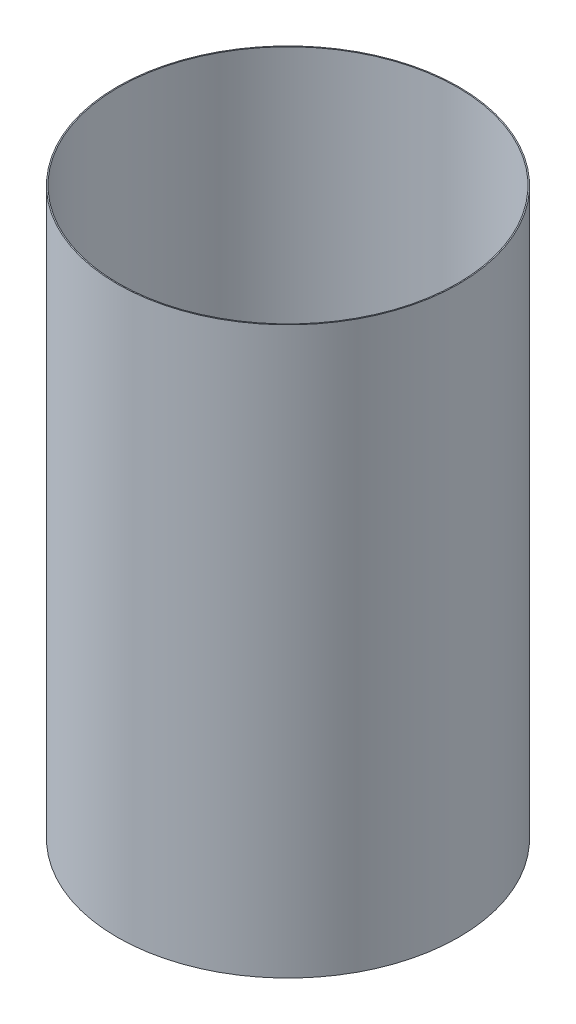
from build123d import *

# Parameters (mm, degrees)
SKETCH1_W = 0.254
SKETCH1_H = 133.35


with BuildPart() as part:
    # Sketch1 → Revolve-Thin1 (revolve)
    with BuildSketch(Plane.XY, mode=Mode.PRIVATE) as revolve_thin1_sk:
        with Locations((-40.132, -135.67819341)):
            Rectangle(SKETCH1_W, SKETCH1_H)
    revolve(revolve_thin1_sk.sketch.rotate(Axis((0, 55, 0), (0, -1, 0)), 270), axis=Axis((0, 55, 0), (0, -1, 0)))


solid = part.part
